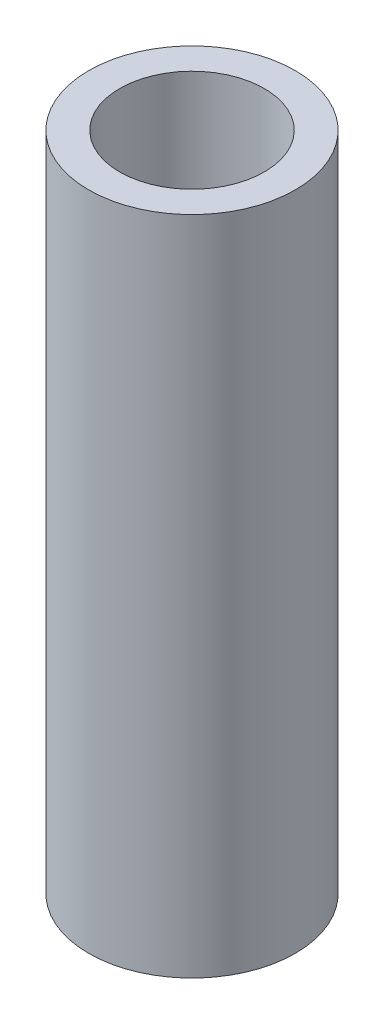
ISO-10303-21;
HEADER;
FILE_DESCRIPTION(('STEP AP214'),'2;1');
FILE_NAME('part.step','',(''),(''),'','','');
FILE_SCHEMA(('AUTOMOTIVE_DESIGN { 1 0 10303 214 1 1 1 1 }'));
ENDSEC;
DATA;
#1=APPLICATION_CONTEXT('core data for automotive mechanical design processes');
#2=APPLICATION_PROTOCOL_DEFINITION('international standard','automotive_design',2000,#1);
#3=PRODUCT_CONTEXT('',#1,'mechanical');
#4=PRODUCT('Part','Part','',(#3));
#5=PRODUCT_RELATED_PRODUCT_CATEGORY('part','',(#4));
#6=PRODUCT_DEFINITION_FORMATION('','',#4);
#7=PRODUCT_DEFINITION_CONTEXT('part definition',#1,'design');
#8=PRODUCT_DEFINITION('design','',#6,#7);
#9=PRODUCT_DEFINITION_SHAPE('','',#8);
#10=(LENGTH_UNIT() NAMED_UNIT(*) SI_UNIT(.MILLI.,.METRE.));
#11=(NAMED_UNIT(*) PLANE_ANGLE_UNIT() SI_UNIT($,.RADIAN.));
#12=(NAMED_UNIT(*) SI_UNIT($,.STERADIAN.) SOLID_ANGLE_UNIT());
#13=UNCERTAINTY_MEASURE_WITH_UNIT(LENGTH_MEASURE(1.E-05),#10,'distance_accuracy_value','');
#14=(GEOMETRIC_REPRESENTATION_CONTEXT(3) GLOBAL_UNCERTAINTY_ASSIGNED_CONTEXT((#13)) GLOBAL_UNIT_ASSIGNED_CONTEXT((#10,
#11,#12)) REPRESENTATION_CONTEXT('',''));
#15=CARTESIAN_POINT('',(0.,0.,0.));
#16=DIRECTION('',(0.,0.,1.));
#17=DIRECTION('',(1.,0.,0.));
#18=AXIS2_PLACEMENT_3D('',#15,#16,#17);
#19=CARTESIAN_POINT('',(0.,50.8,0.));
#20=DIRECTION('',(0.,1.,0.));
#21=DIRECTION('',(0.,0.,1.));
#22=AXIS2_PLACEMENT_3D('',#19,#20,#21);
#23=PLANE('',#22);
#24=CARTESIAN_POINT('',(0.,50.8,0.));
#25=DIRECTION('',(0.,1.,0.));
#26=DIRECTION('',(0.,0.,1.));
#27=AXIS2_PLACEMENT_3D('',#24,#25,#26);
#28=CIRCLE('',#27,7.9375);
#29=CARTESIAN_POINT('',(0.,50.8,7.9375));
#30=VERTEX_POINT('',#29);
#31=EDGE_CURVE('E10',#30,#30,#28,.T.);
#32=ORIENTED_EDGE('',*,*,#31,.T.);
#33=EDGE_LOOP('',(#32));
#34=FACE_BOUND('',#33,.T.);
#35=CARTESIAN_POINT('',(0.,50.8,0.));
#36=DIRECTION('',(0.,1.,0.));
#37=DIRECTION('',(0.,0.,1.));
#38=AXIS2_PLACEMENT_3D('',#35,#36,#37);
#39=CIRCLE('',#38,5.55624999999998);
#40=CARTESIAN_POINT('',(0.,50.8,5.55624999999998));
#41=VERTEX_POINT('',#40);
#42=EDGE_CURVE('E42',#41,#41,#39,.T.);
#43=ORIENTED_EDGE('',*,*,#42,.F.);
#44=EDGE_LOOP('',(#43));
#45=FACE_BOUND('',#44,.T.);
#46=ADVANCED_FACE('F31',(#34,#45),#23,.T.);
#47=CARTESIAN_POINT('',(0.,0.,0.));
#48=DIRECTION('',(0.,1.,0.));
#49=DIRECTION('',(0.,0.,1.));
#50=AXIS2_PLACEMENT_3D('',#47,#48,#49);
#51=PLANE('',#50);
#52=CARTESIAN_POINT('',(0.,0.,0.));
#53=DIRECTION('',(0.,1.,0.));
#54=DIRECTION('',(0.,0.,1.));
#55=AXIS2_PLACEMENT_3D('',#52,#53,#54);
#56=CIRCLE('',#55,7.9375);
#57=CARTESIAN_POINT('',(0.,0.,7.9375));
#58=VERTEX_POINT('',#57);
#59=EDGE_CURVE('E35',#58,#58,#56,.T.);
#60=ORIENTED_EDGE('',*,*,#59,.F.);
#61=EDGE_LOOP('',(#60));
#62=FACE_BOUND('',#61,.T.);
#63=CARTESIAN_POINT('',(0.,0.,0.));
#64=DIRECTION('',(0.,1.,0.));
#65=DIRECTION('',(0.,0.,1.));
#66=AXIS2_PLACEMENT_3D('',#63,#64,#65);
#67=CIRCLE('',#66,5.55624999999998);
#68=CARTESIAN_POINT('',(0.,0.,5.55624999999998));
#69=VERTEX_POINT('',#68);
#70=EDGE_CURVE('E44',#69,#69,#67,.T.);
#71=ORIENTED_EDGE('',*,*,#70,.T.);
#72=EDGE_LOOP('',(#71));
#73=FACE_BOUND('',#72,.T.);
#74=ADVANCED_FACE('F54',(#62,#73),#51,.F.);
#75=CARTESIAN_POINT('',(0.,50.8,0.));
#76=DIRECTION('',(0.,-1.,0.));
#77=DIRECTION('',(0.,0.,-1.));
#78=AXIS2_PLACEMENT_3D('',#75,#76,#77);
#79=CYLINDRICAL_SURFACE('',#78,7.9375);
#80=ORIENTED_EDGE('',*,*,#31,.F.);
#81=EDGE_LOOP('',(#80));
#82=FACE_BOUND('',#81,.T.);
#83=ORIENTED_EDGE('',*,*,#59,.T.);
#84=EDGE_LOOP('',(#83));
#85=FACE_BOUND('',#84,.T.);
#86=ADVANCED_FACE('F33',(#82,#85),#79,.T.);
#87=CARTESIAN_POINT('',(0.,50.8,0.));
#88=DIRECTION('',(0.,-1.,0.));
#89=DIRECTION('',(0.,0.,-1.));
#90=AXIS2_PLACEMENT_3D('',#87,#88,#89);
#91=CYLINDRICAL_SURFACE('',#90,5.55624999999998);
#92=ORIENTED_EDGE('',*,*,#42,.T.);
#93=EDGE_LOOP('',(#92));
#94=FACE_BOUND('',#93,.T.);
#95=ORIENTED_EDGE('',*,*,#70,.F.);
#96=EDGE_LOOP('',(#95));
#97=FACE_BOUND('',#96,.T.);
#98=ADVANCED_FACE('F50',(#94,#97),#91,.F.);
#99=CLOSED_SHELL('',(#46,#74,#86,#98));
#100=MANIFOLD_SOLID_BREP('B2',#99);
#101=ADVANCED_BREP_SHAPE_REPRESENTATION('',(#18,#100),#14);
#102=SHAPE_DEFINITION_REPRESENTATION(#9,#101);
ENDSEC;
END-ISO-10303-21;
